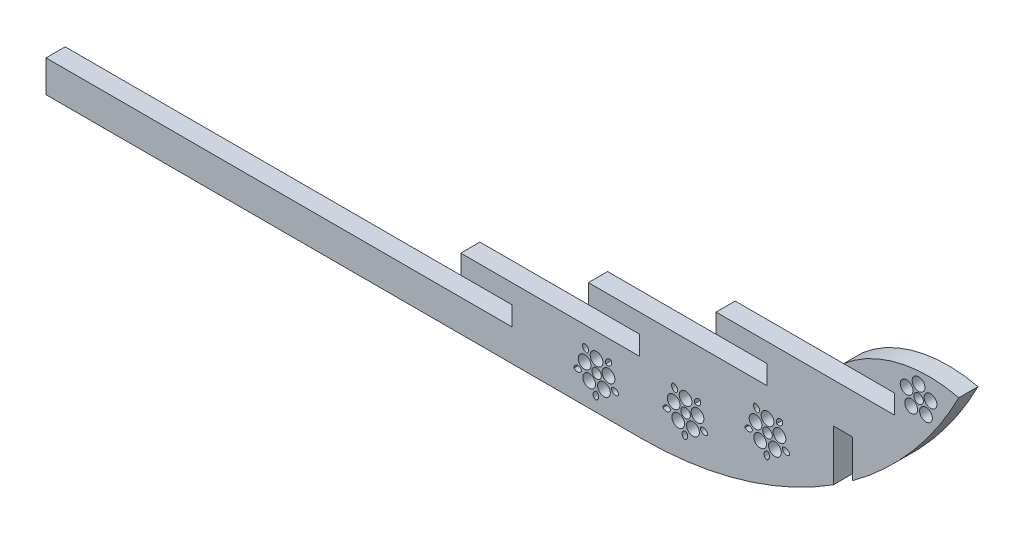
from build123d import *

# Parameters (mm, degrees)
SKETCH1_R           = 0.75
SKETCH1_R_2         = 1
BOSS_EXTRUDE1_DEPTH = 3


with BuildPart() as part:
    # Sketch1 → Boss-Extrude1 (new body)
    with BuildSketch(Plane.XY):
        with BuildLine():
            Line((-25.3989367, -4.538368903), (-25.3989367, -7.538368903))
            Line((-25.3989367, -7.538368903), (-53.3989367, -7.538368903))
            Line((-53.3989367, -7.538368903), (-53.3989367, -10.538368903))
            Line((-53.3989367, -10.538368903), (-45.3989367, -10.538368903))
            Line((-45.3989367, -10.538368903), (-45.3989367, -13.538368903))
            Line((-45.3989367, -13.538368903), (-73.3989367, -13.538368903))
            Line((-73.3989367, -13.538368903), (-73.3989367, -16.538368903))
            Line((-73.3989367, -16.538368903), (-65.3989367, -16.538368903))
            Line((-65.3989367, -16.538368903), (-65.3989367, -19.538368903))
            Line((-65.3989367, -19.538368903), (-138.3989367, -19.538368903))
            Line((-138.3989367, -19.538368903), (-138.3989367, -24.538368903))
            Line((-138.3989367, -24.538368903), (-44.989209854, -24.538368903))
            ThreePointArc((-44.989209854, -24.538368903), (-29.377409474, -22.307131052), (-15.015629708, -15.79207039))
            Line((-15.015629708, -15.79207039), (-15.015826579, -7.792070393))
            Line((-15.015826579, -7.792070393), (-12.015826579, -7.792070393))
            Line((-12.015826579, -7.792070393), (-12.015680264, -13.737668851))
            ThreePointArc((-12.015680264, -13.737668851), (-2.533837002, -4.912222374), (4.654576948, 5.863702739))
            ThreePointArc((4.654576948, 5.863702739), (-4.901443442, 5.833251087), (-13.3989367, 1.461631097))
            Line((-13.3989367, 1.461631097), (-5.3989367, 1.461631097))
            Line((-5.3989367, 1.461631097), (-5.3989367, -1.538368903))
            Line((-5.3989367, -1.538368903), (-33.3989367, -1.538368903))
            Line((-33.3989367, -1.538368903), (-33.3989367, -4.538368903))
            Line((-33.3989367, -4.538368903), (-25.3989367, -4.538368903))
        make_face()
        with Locations((-1.659476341, 2.593925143)):
            Circle(SKETCH1_R, mode=Mode.SUBTRACT)
        with Locations((-38.171093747, -17.617335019)):
            Circle(SKETCH1_R, mode=Mode.SUBTRACT)
        with Locations((-1.659476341, 4.563264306)):
            Circle(SKETCH1_R_2, mode=Mode.SUBTRACT)
        with Locations((0.213476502, 3.202484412)):
            Circle(SKETCH1_R_2, mode=Mode.SUBTRACT)
        with Locations((-0.501927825, 1.000696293)):
            Circle(SKETCH1_R_2, mode=Mode.SUBTRACT)
        with Locations((-2.817024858, 1.000696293)):
            Circle(SKETCH1_R_2, mode=Mode.SUBTRACT)
        with Locations((-3.532429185, 3.202484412)):
            Circle(SKETCH1_R_2, mode=Mode.SUBTRACT)
        with Locations((-39.328642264, -19.210563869)):
            Circle(SKETCH1_R_2, mode=Mode.SUBTRACT)
        with Locations((-38.171093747, -15.647995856)):
            Circle(SKETCH1_R_2, mode=Mode.SUBTRACT)
        with Locations((-40.044046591, -17.00877575)):
            Circle(SKETCH1_R_2, mode=Mode.SUBTRACT)
        with Locations((-36.298140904, -17.00877575)):
            Circle(SKETCH1_R_2, mode=Mode.SUBTRACT)
        with Locations((-37.013545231, -19.210563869)):
            Circle(SKETCH1_R_2, mode=Mode.SUBTRACT)
        with Locations((-24.173555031, -15.52087165)):
            Circle(SKETCH1_R_2, mode=Mode.SUBTRACT)
        with Locations((-26.488652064, -15.52087165)):
            Circle(SKETCH1_R_2, mode=Mode.SUBTRACT)
        with Locations((-25.331103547, -13.927642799)):
            Circle(SKETCH1_R, mode=Mode.SUBTRACT)
        with Locations((-23.458150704, -13.31908353)):
            Circle(SKETCH1_R_2, mode=Mode.SUBTRACT)
        with Locations((-27.204056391, -13.31908353)):
            Circle(SKETCH1_R_2, mode=Mode.SUBTRACT)
        with Locations((-25.331103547, -11.958303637)):
            Circle(SKETCH1_R_2, mode=Mode.SUBTRACT)
        with Locations((-52.119440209, -17.241224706)):
            Circle(SKETCH1_R_2, mode=Mode.SUBTRACT)
        with Locations((-50.246487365, -18.6020046)):
            Circle(SKETCH1_R_2, mode=Mode.SUBTRACT)
        with Locations((-50.961891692, -20.803792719)):
            Circle(SKETCH1_R_2, mode=Mode.SUBTRACT)
        with Locations((-53.276988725, -20.803792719)):
            Circle(SKETCH1_R_2, mode=Mode.SUBTRACT)
        with Locations((-53.992393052, -18.6020046)):
            Circle(SKETCH1_R_2, mode=Mode.SUBTRACT)
        with Locations((-52.119440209, -19.210563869)):
            Circle(SKETCH1_R, mode=Mode.SUBTRACT)
        with BuildLine():
            ThreePointArc((-36.736077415, -15.615535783), (-36.603805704, -14.903556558), (-35.908749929, -14.700313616))
            ThreePointArc((-35.908749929, -14.700313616), (-35.957723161, -15.487591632), (-36.736077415, -15.615535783))
        make_face(mode=Mode.SUBTRACT)
        with BuildLine():
            ThreePointArc((-39.631473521, -15.633963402), (-40.267731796, -15.288151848), (-40.246243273, -14.564309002))
            ThreePointArc((-40.246243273, -14.564309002), (-39.512630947, -14.854167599), (-39.631473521, -15.633963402))
        make_face(mode=Mode.SUBTRACT)
        with BuildLine():
            ThreePointArc((-38.286786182, -21.307027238), (-38.709916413, -20.6413202), (-38.155418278, -20.080306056))
            ThreePointArc((-38.155418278, -20.080306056), (-37.843937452, -20.73405671), (-38.286786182, -21.307027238))
        make_face(mode=Mode.SUBTRACT)
        with BuildLine():
            ThreePointArc((-35.823825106, -18.363526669), (-35.105818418, -18.269310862), (-34.697738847, -18.867542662))
            ThreePointArc((-34.697738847, -18.867542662), (-35.461618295, -19.064248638), (-35.823825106, -18.363526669))
        make_face(mode=Mode.SUBTRACT)
        with BuildLine():
            ThreePointArc((-40.508674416, -18.393343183), (-41.034175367, -18.891599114), (-41.715950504, -18.647482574))
            ThreePointArc((-41.715950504, -18.647482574), (-41.21357992, -18.039347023), (-40.508674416, -18.393343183))
        make_face(mode=Mode.SUBTRACT)
        with BuildLine():
            ThreePointArc((-27.668684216, -14.703650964), (-28.194185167, -15.201906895), (-28.875960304, -14.957790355))
            ThreePointArc((-28.875960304, -14.957790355), (-28.373589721, -14.349654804), (-27.668684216, -14.703650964))
        make_face(mode=Mode.SUBTRACT)
        with BuildLine():
            ThreePointArc((-21.857748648, -15.177850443), (-22.621628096, -15.374556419), (-22.983834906, -14.673834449))
            ThreePointArc((-22.983834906, -14.673834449), (-22.265828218, -14.579618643), (-21.857748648, -15.177850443))
        make_face(mode=Mode.SUBTRACT)
        with BuildLine():
            ThreePointArc((-25.315428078, -16.390613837), (-25.003947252, -17.044364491), (-25.446795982, -17.617335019))
            ThreePointArc((-25.446795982, -17.617335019), (-25.869926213, -16.951627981), (-25.315428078, -16.390613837))
        make_face(mode=Mode.SUBTRACT)
        with BuildLine():
            ThreePointArc((-23.896087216, -11.925843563), (-23.763815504, -11.213864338), (-23.06875973, -11.010621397))
            ThreePointArc((-23.06875973, -11.010621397), (-23.117732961, -11.797899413), (-23.896087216, -11.925843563))
        make_face(mode=Mode.SUBTRACT)
        with BuildLine():
            ThreePointArc((-26.791483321, -11.944271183), (-27.427741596, -11.598459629), (-27.406253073, -10.874616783))
            ThreePointArc((-27.406253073, -10.874616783), (-26.672640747, -11.16447538), (-26.791483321, -11.944271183))
        make_face(mode=Mode.SUBTRACT)
        with BuildLine():
            ThreePointArc((-55.664296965, -20.240711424), (-55.161926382, -19.632575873), (-54.457020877, -19.986572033))
            ThreePointArc((-54.457020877, -19.986572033), (-54.982521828, -20.484827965), (-55.664296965, -20.240711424))
        make_face(mode=Mode.SUBTRACT)
        with BuildLine():
            ThreePointArc((-52.235132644, -22.900256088), (-52.658262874, -22.234549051), (-52.103764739, -21.673534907))
            ThreePointArc((-52.103764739, -21.673534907), (-51.792283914, -22.327285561), (-52.235132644, -22.900256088))
        make_face(mode=Mode.SUBTRACT)
        with BuildLine():
            ThreePointArc((-53.579819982, -17.227192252), (-54.216078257, -16.881380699), (-54.194589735, -16.157537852))
            ThreePointArc((-54.194589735, -16.157537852), (-53.460977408, -16.447396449), (-53.579819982, -17.227192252))
        make_face(mode=Mode.SUBTRACT)
        with BuildLine():
            ThreePointArc((-48.646085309, -20.460771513), (-49.409964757, -20.657477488), (-49.772171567, -19.956755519))
            ThreePointArc((-49.772171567, -19.956755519), (-49.054164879, -19.862539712), (-48.646085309, -20.460771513))
        make_face(mode=Mode.SUBTRACT)
        with BuildLine():
            ThreePointArc((-50.684423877, -17.208764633), (-50.552152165, -16.496785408), (-49.857096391, -16.293542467))
            ThreePointArc((-49.857096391, -16.293542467), (-49.906069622, -17.080820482), (-50.684423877, -17.208764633))
        make_face(mode=Mode.SUBTRACT)
    extrude(amount=BOSS_EXTRUDE1_DEPTH)


solid = part.part
